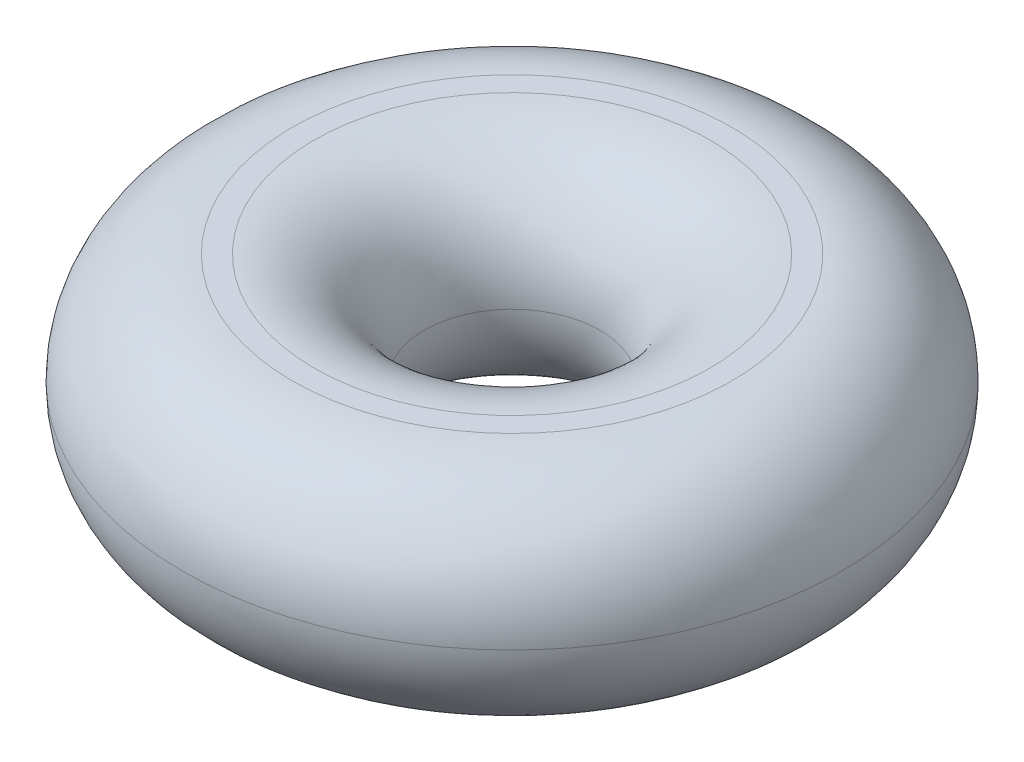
ISO-10303-21;
HEADER;
FILE_DESCRIPTION(('STEP AP214'),'2;1');
FILE_NAME('part.step','',(''),(''),'','','');
FILE_SCHEMA(('AUTOMOTIVE_DESIGN { 1 0 10303 214 1 1 1 1 }'));
ENDSEC;
DATA;
#1=APPLICATION_CONTEXT('core data for automotive mechanical design processes');
#2=APPLICATION_PROTOCOL_DEFINITION('international standard','automotive_design',2000,#1);
#3=PRODUCT_CONTEXT('',#1,'mechanical');
#4=PRODUCT('Part','Part','',(#3));
#5=PRODUCT_RELATED_PRODUCT_CATEGORY('part','',(#4));
#6=PRODUCT_DEFINITION_FORMATION('','',#4);
#7=PRODUCT_DEFINITION_CONTEXT('part definition',#1,'design');
#8=PRODUCT_DEFINITION('design','',#6,#7);
#9=PRODUCT_DEFINITION_SHAPE('','',#8);
#10=(LENGTH_UNIT() NAMED_UNIT(*) SI_UNIT(.MILLI.,.METRE.));
#11=(NAMED_UNIT(*) PLANE_ANGLE_UNIT() SI_UNIT($,.RADIAN.));
#12=(NAMED_UNIT(*) SI_UNIT($,.STERADIAN.) SOLID_ANGLE_UNIT());
#13=UNCERTAINTY_MEASURE_WITH_UNIT(LENGTH_MEASURE(1.E-05),#10,'distance_accuracy_value','');
#14=(GEOMETRIC_REPRESENTATION_CONTEXT(3) GLOBAL_UNCERTAINTY_ASSIGNED_CONTEXT((#13)) GLOBAL_UNIT_ASSIGNED_CONTEXT((#10,
#11,#12)) REPRESENTATION_CONTEXT('',''));
#15=CARTESIAN_POINT('',(0.,0.,0.));
#16=DIRECTION('',(0.,0.,1.));
#17=DIRECTION('',(1.,0.,0.));
#18=AXIS2_PLACEMENT_3D('',#15,#16,#17);
#19=CARTESIAN_POINT('',(0.,15.,0.));
#20=DIRECTION('',(0.,1.,0.));
#21=DIRECTION('',(0.,0.,1.));
#22=AXIS2_PLACEMENT_3D('',#19,#20,#21);
#23=PLANE('',#22);
#24=CARTESIAN_POINT('',(0.,15.,0.));
#25=DIRECTION('',(0.,1.,0.));
#26=DIRECTION('',(0.,0.,1.));
#27=AXIS2_PLACEMENT_3D('',#24,#25,#26);
#28=CIRCLE('',#27,13.5);
#29=CARTESIAN_POINT('',(0.,15.,13.5));
#30=VERTEX_POINT('',#29);
#31=EDGE_CURVE('E10',#30,#30,#28,.F.);
#32=ORIENTED_EDGE('',*,*,#31,.T.);
#33=EDGE_LOOP('',(#32));
#34=FACE_BOUND('',#33,.T.);
#35=CARTESIAN_POINT('',(0.,15.,0.));
#36=DIRECTION('',(0.,1.,0.));
#37=DIRECTION('',(0.,0.,1.));
#38=AXIS2_PLACEMENT_3D('',#35,#36,#37);
#39=CIRCLE('',#38,15.);
#40=CARTESIAN_POINT('',(0.,15.,15.));
#41=VERTEX_POINT('',#40);
#42=EDGE_CURVE('E46',#41,#41,#39,.T.);
#43=ORIENTED_EDGE('',*,*,#42,.T.);
#44=EDGE_LOOP('',(#43));
#45=FACE_BOUND('',#44,.T.);
#46=ADVANCED_FACE('F37',(#34,#45),#23,.T.);
#47=CARTESIAN_POINT('',(0.,0.,0.));
#48=DIRECTION('',(0.,1.,0.));
#49=DIRECTION('',(0.,0.,1.));
#50=AXIS2_PLACEMENT_3D('',#47,#48,#49);
#51=PLANE('',#50);
#52=CARTESIAN_POINT('',(0.,0.,0.));
#53=DIRECTION('',(0.,1.,0.));
#54=DIRECTION('',(0.,0.,1.));
#55=AXIS2_PLACEMENT_3D('',#52,#53,#54);
#56=CIRCLE('',#55,13.5);
#57=CARTESIAN_POINT('',(0.,0.,13.5));
#58=VERTEX_POINT('',#57);
#59=EDGE_CURVE('E52',#58,#58,#56,.T.);
#60=ORIENTED_EDGE('',*,*,#59,.T.);
#61=EDGE_LOOP('',(#60));
#62=FACE_BOUND('',#61,.T.);
#63=CARTESIAN_POINT('',(0.,0.,0.));
#64=DIRECTION('',(0.,1.,0.));
#65=DIRECTION('',(0.,0.,1.));
#66=AXIS2_PLACEMENT_3D('',#63,#64,#65);
#67=CIRCLE('',#66,15.);
#68=CARTESIAN_POINT('',(0.,0.,15.));
#69=VERTEX_POINT('',#68);
#70=EDGE_CURVE('E58',#69,#69,#67,.F.);
#71=ORIENTED_EDGE('',*,*,#70,.T.);
#72=EDGE_LOOP('',(#71));
#73=FACE_BOUND('',#72,.T.);
#74=ADVANCED_FACE('F82',(#62,#73),#51,.F.);
#75=CARTESIAN_POINT('',(0.,7.5,0.));
#76=DIRECTION('',(0.,1.,0.));
#77=DIRECTION('',(0.,0.,1.));
#78=AXIS2_PLACEMENT_3D('',#75,#76,#77);
#79=TOROIDAL_SURFACE('',#78,13.5,7.5);
#80=ORIENTED_EDGE('',*,*,#31,.F.);
#81=EDGE_LOOP('',(#80));
#82=FACE_BOUND('',#81,.T.);
#83=CARTESIAN_POINT('',(0.,7.5,0.));
#84=DIRECTION('',(0.,1.,0.));
#85=DIRECTION('',(0.,0.,1.));
#86=AXIS2_PLACEMENT_3D('',#83,#84,#85);
#87=CIRCLE('',#86,6.);
#88=CARTESIAN_POINT('',(0.,7.5,6.));
#89=VERTEX_POINT('',#88);
#90=EDGE_CURVE('E55',#89,#89,#87,.T.);
#91=ORIENTED_EDGE('',*,*,#90,.F.);
#92=EDGE_LOOP('',(#91));
#93=FACE_BOUND('',#92,.T.);
#94=ADVANCED_FACE('F78',(#82,#93),#79,.T.);
#95=CARTESIAN_POINT('',(0.,7.5,0.));
#96=DIRECTION('',(0.,1.,0.));
#97=DIRECTION('',(0.,0.,1.));
#98=AXIS2_PLACEMENT_3D('',#95,#96,#97);
#99=TOROIDAL_SURFACE('',#98,13.5,7.5);
#100=ORIENTED_EDGE('',*,*,#90,.T.);
#101=EDGE_LOOP('',(#100));
#102=FACE_BOUND('',#101,.T.);
#103=ORIENTED_EDGE('',*,*,#59,.F.);
#104=EDGE_LOOP('',(#103));
#105=FACE_BOUND('',#104,.T.);
#106=ADVANCED_FACE('F71',(#102,#105),#99,.T.);
#107=CARTESIAN_POINT('',(0.,7.5,0.));
#108=DIRECTION('',(0.,1.,0.));
#109=DIRECTION('',(0.,0.,1.));
#110=AXIS2_PLACEMENT_3D('',#107,#108,#109);
#111=TOROIDAL_SURFACE('',#110,15.,7.5);
#112=ORIENTED_EDGE('',*,*,#42,.F.);
#113=EDGE_LOOP('',(#112));
#114=FACE_BOUND('',#113,.T.);
#115=CARTESIAN_POINT('',(0.,7.5,0.));
#116=DIRECTION('',(0.,1.,0.));
#117=DIRECTION('',(0.,0.,1.));
#118=AXIS2_PLACEMENT_3D('',#115,#116,#117);
#119=CIRCLE('',#118,22.5);
#120=CARTESIAN_POINT('',(0.,7.5,22.5));
#121=VERTEX_POINT('',#120);
#122=EDGE_CURVE('E41',#121,#121,#119,.F.);
#123=ORIENTED_EDGE('',*,*,#122,.F.);
#124=EDGE_LOOP('',(#123));
#125=FACE_BOUND('',#124,.T.);
#126=ADVANCED_FACE('F39',(#114,#125),#111,.T.);
#127=CARTESIAN_POINT('',(0.,7.5,0.));
#128=DIRECTION('',(0.,1.,0.));
#129=DIRECTION('',(0.,0.,1.));
#130=AXIS2_PLACEMENT_3D('',#127,#128,#129);
#131=TOROIDAL_SURFACE('',#130,15.,7.5);
#132=ORIENTED_EDGE('',*,*,#70,.F.);
#133=EDGE_LOOP('',(#132));
#134=FACE_BOUND('',#133,.T.);
#135=ORIENTED_EDGE('',*,*,#122,.T.);
#136=EDGE_LOOP('',(#135));
#137=FACE_BOUND('',#136,.T.);
#138=ADVANCED_FACE('F68',(#134,#137),#131,.T.);
#139=CLOSED_SHELL('',(#46,#74,#94,#106,#126,#138));
#140=MANIFOLD_SOLID_BREP('B2',#139);
#141=ADVANCED_BREP_SHAPE_REPRESENTATION('',(#18,#140),#14);
#142=SHAPE_DEFINITION_REPRESENTATION(#9,#141);
ENDSEC;
END-ISO-10303-21;
